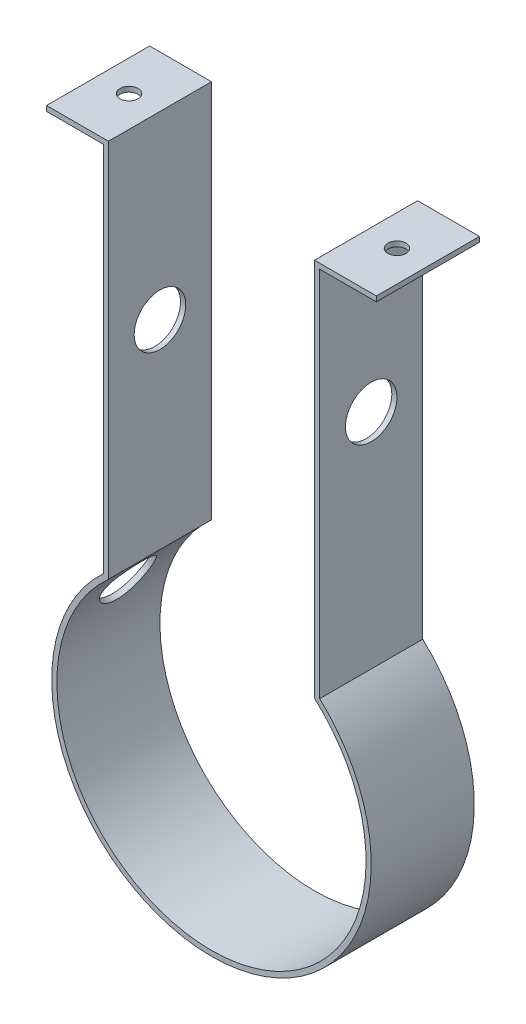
ISO-10303-21;
HEADER;
FILE_DESCRIPTION(('STEP AP214'),'2;1');
FILE_NAME('part.step','',(''),(''),'','','');
FILE_SCHEMA(('AUTOMOTIVE_DESIGN { 1 0 10303 214 1 1 1 1 }'));
ENDSEC;
DATA;
#1=APPLICATION_CONTEXT('core data for automotive mechanical design processes');
#2=APPLICATION_PROTOCOL_DEFINITION('international standard','automotive_design',2000,#1);
#3=PRODUCT_CONTEXT('',#1,'mechanical');
#4=PRODUCT('Part','Part','',(#3));
#5=PRODUCT_RELATED_PRODUCT_CATEGORY('part','',(#4));
#6=PRODUCT_DEFINITION_FORMATION('','',#4);
#7=PRODUCT_DEFINITION_CONTEXT('part definition',#1,'design');
#8=PRODUCT_DEFINITION('design','',#6,#7);
#9=PRODUCT_DEFINITION_SHAPE('','',#8);
#10=(LENGTH_UNIT() NAMED_UNIT(*) SI_UNIT(.MILLI.,.METRE.));
#11=(NAMED_UNIT(*) PLANE_ANGLE_UNIT() SI_UNIT($,.RADIAN.));
#12=(NAMED_UNIT(*) SI_UNIT($,.STERADIAN.) SOLID_ANGLE_UNIT());
#13=UNCERTAINTY_MEASURE_WITH_UNIT(LENGTH_MEASURE(1.E-05),#10,'distance_accuracy_value','');
#14=(GEOMETRIC_REPRESENTATION_CONTEXT(3) GLOBAL_UNCERTAINTY_ASSIGNED_CONTEXT((#13)) GLOBAL_UNIT_ASSIGNED_CONTEXT((#10,
#11,#12)) REPRESENTATION_CONTEXT('',''));
#15=CARTESIAN_POINT('',(0.,0.,0.));
#16=DIRECTION('',(0.,0.,1.));
#17=DIRECTION('',(1.,0.,0.));
#18=AXIS2_PLACEMENT_3D('',#15,#16,#17);
#19=CARTESIAN_POINT('',(0.,0.,20.));
#20=DIRECTION('',(0.,0.,-1.));
#21=DIRECTION('',(-1.,0.,0.));
#22=AXIS2_PLACEMENT_3D('',#19,#20,#21);
#23=CYLINDRICAL_SURFACE('',#22,30.);
#24=CARTESIAN_POINT('',(-28.3312870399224,9.866011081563,10.));
#25=CARTESIAN_POINT('',(-28.3312872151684,9.86600872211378,10.1394236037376));
#26=CARTESIAN_POINT('',(-28.3293427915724,9.87159902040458,10.2788181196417));
#27=CARTESIAN_POINT('',(-28.3215612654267,9.89390298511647,10.5566479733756));
#28=CARTESIAN_POINT('',(-28.3157233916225,9.91061885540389,10.695083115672));
#29=CARTESIAN_POINT('',(-28.3001389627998,9.95503315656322,10.9700426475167));
#30=CARTESIAN_POINT('',(-28.2903899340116,9.98273853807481,11.1065657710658));
#31=CARTESIAN_POINT('',(-28.2669632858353,10.0488813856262,11.3766966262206));
#32=CARTESIAN_POINT('',(-28.2532842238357,10.0873227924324,11.5103032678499));
#33=CARTESIAN_POINT('',(-28.2219986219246,10.1745238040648,11.7734487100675));
#34=CARTESIAN_POINT('',(-28.2043968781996,10.2232708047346,11.9029922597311));
#35=CARTESIAN_POINT('',(-28.1652288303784,10.3306898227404,12.1573324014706));
#36=CARTESIAN_POINT('',(-28.143661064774,10.3893654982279,12.2821272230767));
#37=CARTESIAN_POINT('',(-28.0965588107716,10.5160804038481,12.526005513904));
#38=CARTESIAN_POINT('',(-28.0710262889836,10.5841149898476,12.6450917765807));
#39=CARTESIAN_POINT('',(-28.0159649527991,10.7290127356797,12.8768565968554));
#40=CARTESIAN_POINT('',(-27.9864346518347,10.8058791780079,12.9895327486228));
#41=CARTESIAN_POINT('',(-27.9231177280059,10.9684624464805,13.2085948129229));
#42=CARTESIAN_POINT('',(-27.8892972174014,11.054248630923,13.3149194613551));
#43=CARTESIAN_POINT('',(-27.8176029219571,11.2334447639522,13.5195432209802));
#44=CARTESIAN_POINT('',(-27.7797276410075,11.3268575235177,13.6178393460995));
#45=CARTESIAN_POINT('',(-27.6999874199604,11.5204884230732,13.8056575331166));
#46=CARTESIAN_POINT('',(-27.6581237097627,11.6207044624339,13.8951822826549));
#47=CARTESIAN_POINT('',(-27.5704528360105,11.8272023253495,14.0649008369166));
#48=CARTESIAN_POINT('',(-27.5246442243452,11.9334863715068,14.1450911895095));
#49=CARTESIAN_POINT('',(-27.428937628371,12.1518585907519,14.2959588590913));
#50=CARTESIAN_POINT('',(-27.3790181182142,12.2639760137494,14.3665802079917));
#51=CARTESIAN_POINT('',(-27.2754543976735,12.492611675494,14.4972839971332));
#52=CARTESIAN_POINT('',(-27.2218088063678,12.6091315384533,14.55736250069));
#53=CARTESIAN_POINT('',(-27.1110340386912,12.8455770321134,14.6664777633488));
#54=CARTESIAN_POINT('',(-27.0539063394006,12.965501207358,14.7155191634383));
#55=CARTESIAN_POINT('',(-26.9364160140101,13.2078648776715,14.802233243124));
#56=CARTESIAN_POINT('',(-26.8760522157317,13.330305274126,14.8399017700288));
#57=CARTESIAN_POINT('',(-26.6917504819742,13.6976132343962,14.9347309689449));
#58=CARTESIAN_POINT('',(-26.5634487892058,13.944941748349,14.9748513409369));
#59=CARTESIAN_POINT('',(-26.2986293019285,14.4381641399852,15.0078459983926));
#60=CARTESIAN_POINT('',(-26.1621120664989,14.6840581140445,15.0007234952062));
#61=CARTESIAN_POINT('',(-25.8862100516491,15.1650988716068,14.9398334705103));
#62=CARTESIAN_POINT('',(-25.7468670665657,15.4003279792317,14.8865286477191));
#63=CARTESIAN_POINT('',(-25.4685895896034,15.8563033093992,14.7354988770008));
#64=CARTESIAN_POINT('',(-25.3296551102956,16.0770490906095,14.6377725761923));
#65=CARTESIAN_POINT('',(-25.0564917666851,16.4995714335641,14.4002184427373));
#66=CARTESIAN_POINT('',(-24.9222873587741,16.7012565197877,14.2601999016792));
#67=CARTESIAN_POINT('',(-24.6643615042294,17.0798662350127,13.9421744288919));
#68=CARTESIAN_POINT('',(-24.5406409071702,17.2567888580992,13.7641644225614));
#69=CARTESIAN_POINT('',(-24.3072703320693,17.5840144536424,13.372642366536));
#70=CARTESIAN_POINT('',(-24.1978092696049,17.7339684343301,13.1587258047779));
#71=CARTESIAN_POINT('',(-23.9995529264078,18.0013681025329,12.7028258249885));
#72=CARTESIAN_POINT('',(-23.9107578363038,18.1188134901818,12.4608421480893));
#73=CARTESIAN_POINT('',(-23.7578949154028,18.3187981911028,11.9552167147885));
#74=CARTESIAN_POINT('',(-23.6938548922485,18.4012982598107,11.6915510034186));
#75=CARTESIAN_POINT('',(-23.5938276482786,18.5293811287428,11.1503018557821));
#76=CARTESIAN_POINT('',(-23.5578379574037,18.5749671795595,10.8727196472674));
#77=CARTESIAN_POINT('',(-23.5160161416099,18.6278856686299,10.3150676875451));
#78=CARTESIAN_POINT('',(-23.5098289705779,18.6356684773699,10.035067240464));
#79=CARTESIAN_POINT('',(-23.5269662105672,18.6140281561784,9.4774266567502));
#80=CARTESIAN_POINT('',(-23.5502894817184,18.5846064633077,9.19978642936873));
#81=CARTESIAN_POINT('',(-23.6250139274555,18.489518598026,8.65654448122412));
#82=CARTESIAN_POINT('',(-23.6762365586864,18.4240828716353,8.39087771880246));
#83=CARTESIAN_POINT('',(-23.8041391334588,18.258527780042,7.87705966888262));
#84=CARTESIAN_POINT('',(-23.8808205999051,18.1584063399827,7.62890943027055));
#85=CARTESIAN_POINT('',(-24.0568972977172,17.9244871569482,7.15465080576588));
#86=CARTESIAN_POINT('',(-24.1564955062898,17.7903873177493,6.92876683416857));
#87=CARTESIAN_POINT('',(-24.3735800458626,17.4917861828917,6.50777295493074));
#88=CARTESIAN_POINT('',(-24.4910676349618,17.327282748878,6.31266521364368));
#89=CARTESIAN_POINT('',(-24.7403100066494,16.969531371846,5.95669613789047));
#90=CARTESIAN_POINT('',(-24.8722004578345,16.7760022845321,5.7962120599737));
#91=CARTESIAN_POINT('',(-25.1439197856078,16.3659306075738,5.51668963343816));
#92=CARTESIAN_POINT('',(-25.2837484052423,16.1493887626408,5.39764994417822));
#93=CARTESIAN_POINT('',(-25.5654008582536,15.6996931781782,5.20497776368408));
#94=CARTESIAN_POINT('',(-25.7072132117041,15.4666166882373,5.13114786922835));
#95=CARTESIAN_POINT('',(-25.9885541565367,14.9890500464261,5.03037278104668));
#96=CARTESIAN_POINT('',(-26.1280829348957,14.7445608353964,5.00342372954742));
#97=CARTESIAN_POINT('',(-26.3313576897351,14.3763407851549,4.99876099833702));
#98=CARTESIAN_POINT('',(-26.397756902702,14.2540431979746,5.00304474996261));
#99=CARTESIAN_POINT('',(-26.5284535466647,14.0092943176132,5.02318820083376));
#100=CARTESIAN_POINT('',(-26.5927517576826,13.8868430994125,5.03904355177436));
#101=CARTESIAN_POINT('',(-26.7188574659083,13.6426378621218,5.08222169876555));
#102=CARTESIAN_POINT('',(-26.780664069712,13.5208841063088,5.10954856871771));
#103=CARTESIAN_POINT('',(-26.9013924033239,13.2790564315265,5.17544736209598));
#104=CARTESIAN_POINT('',(-26.9603151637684,13.1589819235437,5.21401523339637));
#105=CARTESIAN_POINT('',(-27.0749544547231,12.9214635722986,5.30207797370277));
#106=CARTESIAN_POINT('',(-27.1306734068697,12.804017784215,5.35156444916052));
#107=CARTESIAN_POINT('',(-27.2386911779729,12.572589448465,5.46109866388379));
#108=CARTESIAN_POINT('',(-27.2909912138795,12.4586056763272,5.52114261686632));
#109=CARTESIAN_POINT('',(-27.3920206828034,12.2348794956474,5.65139888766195));
#110=CARTESIAN_POINT('',(-27.440748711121,12.1251387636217,5.72161517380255));
#111=CARTESIAN_POINT('',(-27.534450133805,11.9108241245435,5.87167844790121));
#112=CARTESIAN_POINT('',(-27.5794248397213,11.8062484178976,5.95152204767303));
#113=CARTESIAN_POINT('',(-27.6660456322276,11.6018269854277,6.12130955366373));
#114=CARTESIAN_POINT('',(-27.7076460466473,11.5020518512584,6.21136177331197));
#115=CARTESIAN_POINT('',(-27.7868328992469,11.309410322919,6.40012486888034));
#116=CARTESIAN_POINT('',(-27.824420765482,11.2165414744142,6.49883264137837));
#117=CARTESIAN_POINT('',(-27.8955817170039,11.0383753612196,6.70431932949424));
#118=CARTESIAN_POINT('',(-27.9291523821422,10.9530826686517,6.81110304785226));
#119=CARTESIAN_POINT('',(-27.9922250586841,10.7908715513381,7.0319184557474));
#120=CARTESIAN_POINT('',(-28.0217285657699,10.7139500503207,7.14594745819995));
#121=CARTESIAN_POINT('',(-28.0768882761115,10.5685589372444,7.38138656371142));
#122=CARTESIAN_POINT('',(-28.10251410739,10.5001567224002,7.50284542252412));
#123=CARTESIAN_POINT('',(-28.1496563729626,10.3731112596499,7.75146934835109));
#124=CARTESIAN_POINT('',(-28.1711743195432,10.314464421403,7.87863229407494));
#125=CARTESIAN_POINT('',(-28.210118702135,10.2074701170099,8.13772401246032));
#126=CARTESIAN_POINT('',(-28.2275479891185,10.1591154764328,8.2696493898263));
#127=CARTESIAN_POINT('',(-28.2583510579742,10.073116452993,8.53736024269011));
#128=CARTESIAN_POINT('',(-28.2717257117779,10.0354697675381,8.67314488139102));
#129=CARTESIAN_POINT('',(-28.2991694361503,9.95788037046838,9.00472207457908));
#130=CARTESIAN_POINT('',(-28.3112186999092,9.92348113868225,9.20200940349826));
#131=CARTESIAN_POINT('',(-28.3272773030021,9.87754839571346,9.59955118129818));
#132=CARTESIAN_POINT('',(-28.3312867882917,9.86601446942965,9.79980557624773));
#133=CARTESIAN_POINT('',(-28.3312870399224,9.866011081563,10.));
#134=B_SPLINE_CURVE_WITH_KNOTS('',3,(#24,#25,#26,#27,#28,#29,#30,#31,#32,#33,#34,#35,#36,#37,
#38,#39,#40,#41,#42,#43,#44,#45,#46,#47,#48,#49,#50,#51,#52,#53,#54,#55,#56,#57,#58,#59,#60,#61,
#62,#63,#64,#65,#66,#67,#68,#69,#70,#71,#72,#73,#74,#75,#76,#77,#78,#79,#80,#81,#82,#83,#84,#85,
#86,#87,#88,#89,#90,#91,#92,#93,#94,#95,#96,#97,#98,#99,#100,#101,#102,#103,#104,#105,#106,#107,
#108,#109,#110,#111,#112,#113,#114,#115,#116,#117,#118,#119,#120,#121,#122,#123,#124,#125,#126,
#127,#128,#129,#130,#131,#132,#133),.UNSPECIFIED.,.T.,.F.,(4,2,2,2,2,2,2,2,2,2,2,2,2,2,2,2,2,2,
2,2,2,2,2,2,2,2,2,2,2,2,2,2,2,2,2,2,2,2,2,2,2,2,2,2,2,2,2,2,2,2,2,2,2,2,4),(0.,
0.418095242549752,0.836273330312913,1.25471632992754,1.67331312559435,2.09140089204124,
2.50964303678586,2.92767838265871,3.34586960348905,3.76759791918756,4.18948238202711,
4.61123716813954,5.03314743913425,5.45742771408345,5.88186607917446,6.30612563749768,
6.73053992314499,7.57061257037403,8.41062811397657,9.24232364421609,10.0740445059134,
10.9095733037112,11.745169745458,12.5909036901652,13.4366454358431,14.2833344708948,
15.1299489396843,15.9664520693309,16.8029228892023,17.6341025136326,18.4653318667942,
19.3042280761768,20.1431833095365,20.9908634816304,21.8385162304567,22.6824409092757,
23.5262961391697,23.9435677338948,24.3606826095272,24.7779457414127,25.1950586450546,
25.6118520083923,26.0284961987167,26.4453033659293,26.8619642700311,27.2835543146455,
27.7049938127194,28.1266859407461,28.5482225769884,28.9729067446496,29.3974342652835,
29.8216648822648,30.2458042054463,30.8461462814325,31.4464774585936),.UNSPECIFIED.);
#135=CARTESIAN_POINT('',(-28.3312870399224,9.866011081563,10.));
#136=VERTEX_POINT('',#135);
#137=EDGE_CURVE('E281',#136,#136,#134,.T.);
#138=ORIENTED_EDGE('',*,*,#137,.T.);
#139=EDGE_LOOP('',(#138));
#140=FACE_BOUND('',#139,.T.);
#141=CARTESIAN_POINT('',(0.,0.,0.));
#142=DIRECTION('',(0.,0.,-1.));
#143=DIRECTION('',(1.,0.,0.));
#144=AXIS2_PLACEMENT_3D('',#141,#142,#143);
#145=CIRCLE('',#144,30.);
#146=CARTESIAN_POINT('',(20.,22.3606797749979,0.));
#147=VERTEX_POINT('',#146);
#148=CARTESIAN_POINT('',(-20.,22.3606797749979,0.));
#149=VERTEX_POINT('',#148);
#150=EDGE_CURVE('E158',#147,#149,#145,.T.);
#151=ORIENTED_EDGE('',*,*,#150,.T.);
#152=DIRECTION('',(0.,0.,-1.));
#153=VECTOR('',#152,1.);
#154=CARTESIAN_POINT('',(-20.,22.3606797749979,20.));
#155=LINE('',#154,#153);
#156=CARTESIAN_POINT('',(-20.,22.3606797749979,20.));
#157=VERTEX_POINT('',#156);
#158=EDGE_CURVE('E11',#157,#149,#155,.T.);
#159=ORIENTED_EDGE('',*,*,#158,.F.);
#160=CARTESIAN_POINT('',(0.,0.,20.));
#161=DIRECTION('',(0.,0.,-1.));
#162=DIRECTION('',(1.,0.,0.));
#163=AXIS2_PLACEMENT_3D('',#160,#161,#162);
#164=CIRCLE('',#163,30.);
#165=CARTESIAN_POINT('',(20.,22.3606797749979,20.));
#166=VERTEX_POINT('',#165);
#167=EDGE_CURVE('E181',#166,#157,#164,.T.);
#168=ORIENTED_EDGE('',*,*,#167,.F.);
#169=DIRECTION('',(0.,0.,-1.));
#170=VECTOR('',#169,1.);
#171=CARTESIAN_POINT('',(20.,22.3606797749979,20.));
#172=LINE('',#171,#170);
#173=EDGE_CURVE('E154',#166,#147,#172,.T.);
#174=ORIENTED_EDGE('',*,*,#173,.T.);
#175=EDGE_LOOP('',(#151,#159,#168,#174));
#176=FACE_BOUND('',#175,.T.);
#177=ADVANCED_FACE('F31',(#140,#176),#23,.F.);
#178=CARTESIAN_POINT('',(-20.,22.3606797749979,20.));
#179=DIRECTION('',(-1.,0.,0.));
#180=DIRECTION('',(0.,0.,1.));
#181=AXIS2_PLACEMENT_3D('',#178,#179,#180);
#182=PLANE('',#181);
#183=CARTESIAN_POINT('',(-20.,61.,10.));
#184=DIRECTION('',(-1.,0.,0.));
#185=DIRECTION('',(0.,0.,1.));
#186=AXIS2_PLACEMENT_3D('',#183,#184,#185);
#187=CIRCLE('',#186,5.);
#188=CARTESIAN_POINT('',(-20.,61.,15.));
#189=VERTEX_POINT('',#188);
#190=EDGE_CURVE('E217',#189,#189,#187,.T.);
#191=ORIENTED_EDGE('',*,*,#190,.T.);
#192=EDGE_LOOP('',(#191));
#193=FACE_BOUND('',#192,.T.);
#194=DIRECTION('',(0.,1.,0.));
#195=VECTOR('',#194,1.);
#196=CARTESIAN_POINT('',(-20.,22.3606797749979,0.));
#197=LINE('',#196,#195);
#198=CARTESIAN_POINT('',(-20.,96.,0.));
#199=VERTEX_POINT('',#198);
#200=EDGE_CURVE('E161',#149,#199,#197,.T.);
#201=ORIENTED_EDGE('',*,*,#200,.T.);
#202=DIRECTION('',(0.,0.,-1.));
#203=VECTOR('',#202,1.);
#204=CARTESIAN_POINT('',(-20.,96.,20.));
#205=LINE('',#204,#203);
#206=CARTESIAN_POINT('',(-20.,96.,20.));
#207=VERTEX_POINT('',#206);
#208=EDGE_CURVE('E45',#207,#199,#205,.T.);
#209=ORIENTED_EDGE('',*,*,#208,.F.);
#210=DIRECTION('',(0.,1.,0.));
#211=VECTOR('',#210,1.);
#212=CARTESIAN_POINT('',(-20.,22.3606797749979,20.));
#213=LINE('',#212,#211);
#214=EDGE_CURVE('E109',#157,#207,#213,.T.);
#215=ORIENTED_EDGE('',*,*,#214,.F.);
#216=ORIENTED_EDGE('',*,*,#158,.T.);
#217=EDGE_LOOP('',(#201,#209,#215,#216));
#218=FACE_BOUND('',#217,.T.);
#219=ADVANCED_FACE('F272',(#193,#218),#182,.F.);
#220=CARTESIAN_POINT('',(-20.,96.,20.));
#221=DIRECTION('',(0.,-1.,0.));
#222=DIRECTION('',(0.,0.,-1.));
#223=AXIS2_PLACEMENT_3D('',#220,#221,#222);
#224=PLANE('',#223);
#225=CARTESIAN_POINT('',(-26.,96.,10.));
#226=DIRECTION('',(0.,1.,0.));
#227=DIRECTION('',(0.,0.,1.));
#228=AXIS2_PLACEMENT_3D('',#225,#226,#227);
#229=CIRCLE('',#228,1.75);
#230=CARTESIAN_POINT('',(-26.,96.,11.75));
#231=VERTEX_POINT('',#230);
#232=EDGE_CURVE('E208',#231,#231,#229,.T.);
#233=ORIENTED_EDGE('',*,*,#232,.F.);
#234=EDGE_LOOP('',(#233));
#235=FACE_BOUND('',#234,.T.);
#236=DIRECTION('',(-1.,0.,0.));
#237=VECTOR('',#236,1.);
#238=CARTESIAN_POINT('',(-20.,96.,0.));
#239=LINE('',#238,#237);
#240=CARTESIAN_POINT('',(-32.,96.,0.));
#241=VERTEX_POINT('',#240);
#242=EDGE_CURVE('E164',#199,#241,#239,.T.);
#243=ORIENTED_EDGE('',*,*,#242,.T.);
#244=DIRECTION('',(0.,0.,-1.));
#245=VECTOR('',#244,1.);
#246=CARTESIAN_POINT('',(-32.,96.,20.));
#247=LINE('',#246,#245);
#248=CARTESIAN_POINT('',(-32.,96.,20.));
#249=VERTEX_POINT('',#248);
#250=EDGE_CURVE('E200',#249,#241,#247,.T.);
#251=ORIENTED_EDGE('',*,*,#250,.F.);
#252=DIRECTION('',(-1.,0.,0.));
#253=VECTOR('',#252,1.);
#254=CARTESIAN_POINT('',(-20.,96.,20.));
#255=LINE('',#254,#253);
#256=EDGE_CURVE('E232',#207,#249,#255,.T.);
#257=ORIENTED_EDGE('',*,*,#256,.F.);
#258=ORIENTED_EDGE('',*,*,#208,.T.);
#259=EDGE_LOOP('',(#243,#251,#257,#258));
#260=FACE_BOUND('',#259,.T.);
#261=ADVANCED_FACE('F277',(#235,#260),#224,.F.);
#262=CARTESIAN_POINT('',(-32.,96.,20.));
#263=DIRECTION('',(1.,0.,0.));
#264=DIRECTION('',(0.,0.,-1.));
#265=AXIS2_PLACEMENT_3D('',#262,#263,#264);
#266=PLANE('',#265);
#267=DIRECTION('',(0.,-1.,0.));
#268=VECTOR('',#267,1.);
#269=CARTESIAN_POINT('',(-32.,96.,0.));
#270=LINE('',#269,#268);
#271=CARTESIAN_POINT('',(-32.,95.,0.));
#272=VERTEX_POINT('',#271);
#273=EDGE_CURVE('E166',#241,#272,#270,.T.);
#274=ORIENTED_EDGE('',*,*,#273,.T.);
#275=DIRECTION('',(0.,0.,-1.));
#276=VECTOR('',#275,1.);
#277=CARTESIAN_POINT('',(-32.,95.,20.));
#278=LINE('',#277,#276);
#279=CARTESIAN_POINT('',(-32.,95.,20.));
#280=VERTEX_POINT('',#279);
#281=EDGE_CURVE('E197',#280,#272,#278,.T.);
#282=ORIENTED_EDGE('',*,*,#281,.F.);
#283=DIRECTION('',(0.,-1.,0.));
#284=VECTOR('',#283,1.);
#285=CARTESIAN_POINT('',(-32.,96.,20.));
#286=LINE('',#285,#284);
#287=EDGE_CURVE('E234',#249,#280,#286,.T.);
#288=ORIENTED_EDGE('',*,*,#287,.F.);
#289=ORIENTED_EDGE('',*,*,#250,.T.);
#290=EDGE_LOOP('',(#274,#282,#288,#289));
#291=FACE_BOUND('',#290,.T.);
#292=ADVANCED_FACE('F369',(#291),#266,.F.);
#293=CARTESIAN_POINT('',(-21.,95.,20.));
#294=DIRECTION('',(0.,1.,0.));
#295=DIRECTION('',(0.,0.,1.));
#296=AXIS2_PLACEMENT_3D('',#293,#294,#295);
#297=PLANE('',#296);
#298=CARTESIAN_POINT('',(-26.,95.,10.));
#299=DIRECTION('',(0.,1.,0.));
#300=DIRECTION('',(0.,0.,1.));
#301=AXIS2_PLACEMENT_3D('',#298,#299,#300);
#302=CIRCLE('',#301,1.75);
#303=CARTESIAN_POINT('',(-26.,95.,11.75));
#304=VERTEX_POINT('',#303);
#305=EDGE_CURVE('E205',#304,#304,#302,.T.);
#306=ORIENTED_EDGE('',*,*,#305,.T.);
#307=EDGE_LOOP('',(#306));
#308=FACE_BOUND('',#307,.T.);
#309=DIRECTION('',(1.,0.,0.));
#310=VECTOR('',#309,1.);
#311=CARTESIAN_POINT('',(-21.,95.,0.));
#312=LINE('',#311,#310);
#313=CARTESIAN_POINT('',(-21.,95.,0.));
#314=VERTEX_POINT('',#313);
#315=EDGE_CURVE('E168',#272,#314,#312,.T.);
#316=ORIENTED_EDGE('',*,*,#315,.T.);
#317=DIRECTION('',(0.,0.,-1.));
#318=VECTOR('',#317,1.);
#319=CARTESIAN_POINT('',(-21.,95.,20.));
#320=LINE('',#319,#318);
#321=CARTESIAN_POINT('',(-21.,95.,20.));
#322=VERTEX_POINT('',#321);
#323=EDGE_CURVE('E194',#322,#314,#320,.T.);
#324=ORIENTED_EDGE('',*,*,#323,.F.);
#325=DIRECTION('',(1.,0.,0.));
#326=VECTOR('',#325,1.);
#327=CARTESIAN_POINT('',(-21.,95.,20.));
#328=LINE('',#327,#326);
#329=EDGE_CURVE('E236',#280,#322,#328,.T.);
#330=ORIENTED_EDGE('',*,*,#329,.F.);
#331=ORIENTED_EDGE('',*,*,#281,.T.);
#332=EDGE_LOOP('',(#316,#324,#330,#331));
#333=FACE_BOUND('',#332,.T.);
#334=ADVANCED_FACE('F379',(#308,#333),#297,.F.);
#335=CARTESIAN_POINT('',(-21.,22.8035085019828,20.));
#336=DIRECTION('',(1.,0.,0.));
#337=DIRECTION('',(0.,0.,-1.));
#338=AXIS2_PLACEMENT_3D('',#335,#336,#337);
#339=PLANE('',#338);
#340=CARTESIAN_POINT('',(-21.,61.,10.));
#341=DIRECTION('',(-1.,0.,0.));
#342=DIRECTION('',(0.,0.,1.));
#343=AXIS2_PLACEMENT_3D('',#340,#341,#342);
#344=CIRCLE('',#343,5.);
#345=CARTESIAN_POINT('',(-21.,61.,15.));
#346=VERTEX_POINT('',#345);
#347=EDGE_CURVE('E222',#346,#346,#344,.T.);
#348=ORIENTED_EDGE('',*,*,#347,.F.);
#349=EDGE_LOOP('',(#348));
#350=FACE_BOUND('',#349,.T.);
#351=DIRECTION('',(0.,-1.,0.));
#352=VECTOR('',#351,1.);
#353=CARTESIAN_POINT('',(-21.,22.8035085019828,0.));
#354=LINE('',#353,#352);
#355=CARTESIAN_POINT('',(-21.,22.8035085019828,0.));
#356=VERTEX_POINT('',#355);
#357=EDGE_CURVE('E170',#314,#356,#354,.T.);
#358=ORIENTED_EDGE('',*,*,#357,.T.);
#359=DIRECTION('',(0.,0.,-1.));
#360=VECTOR('',#359,1.);
#361=CARTESIAN_POINT('',(-21.,22.8035085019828,20.));
#362=LINE('',#361,#360);
#363=CARTESIAN_POINT('',(-21.,22.8035085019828,20.));
#364=VERTEX_POINT('',#363);
#365=EDGE_CURVE('E191',#364,#356,#362,.T.);
#366=ORIENTED_EDGE('',*,*,#365,.F.);
#367=DIRECTION('',(0.,-1.,0.));
#368=VECTOR('',#367,1.);
#369=CARTESIAN_POINT('',(-21.,22.8035085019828,20.));
#370=LINE('',#369,#368);
#371=EDGE_CURVE('E238',#322,#364,#370,.T.);
#372=ORIENTED_EDGE('',*,*,#371,.F.);
#373=ORIENTED_EDGE('',*,*,#323,.T.);
#374=EDGE_LOOP('',(#358,#366,#372,#373));
#375=FACE_BOUND('',#374,.T.);
#376=ADVANCED_FACE('F347',(#350,#375),#339,.F.);
#377=CARTESIAN_POINT('',(0.,0.,20.));
#378=DIRECTION('',(0.,0.,-1.));
#379=DIRECTION('',(-1.,0.,0.));
#380=AXIS2_PLACEMENT_3D('',#377,#378,#379);
#381=CYLINDRICAL_SURFACE('',#380,31.);
#382=CARTESIAN_POINT('',(-29.2196653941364,10.3542819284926,10.));
#383=CARTESIAN_POINT('',(-29.2196655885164,10.3542796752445,9.8605093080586));
#384=CARTESIAN_POINT('',(-29.2176905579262,10.3598595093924,9.72104689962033));
#385=CARTESIAN_POINT('',(-29.2097873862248,10.3821225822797,9.44308076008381));
#386=CARTESIAN_POINT('',(-29.2038584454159,10.39880806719,9.30457722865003));
#387=CARTESIAN_POINT('',(-29.1880334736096,10.4431438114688,9.02947817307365));
#388=CARTESIAN_POINT('',(-29.1781348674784,10.4708011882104,8.89288394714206));
#389=CARTESIAN_POINT('',(-29.1543543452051,10.53683319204,8.62261121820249));
#390=CARTESIAN_POINT('',(-29.1404709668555,10.5752117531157,8.48893380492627));
#391=CARTESIAN_POINT('',(-29.1087270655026,10.6622770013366,8.22564537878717));
#392=CARTESIAN_POINT('',(-29.090871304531,10.7109513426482,8.09602970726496));
#393=CARTESIAN_POINT('',(-29.0511518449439,10.818218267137,7.84154914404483));
#394=CARTESIAN_POINT('',(-29.0292866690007,10.8768145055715,7.71668602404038));
#395=CARTESIAN_POINT('',(-28.9815541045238,11.0033672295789,7.47267858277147));
#396=CARTESIAN_POINT('',(-28.9556887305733,11.0713190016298,7.35353142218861));
#397=CARTESIAN_POINT('',(-28.8999342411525,11.2160516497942,7.12165417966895));
#398=CARTESIAN_POINT('',(-28.8700436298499,11.2928358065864,7.00892650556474));
#399=CARTESIAN_POINT('',(-28.8060025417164,11.4552124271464,6.78983420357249));
#400=CARTESIAN_POINT('',(-28.7718202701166,11.5408696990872,6.68352689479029));
#401=CARTESIAN_POINT('',(-28.6993982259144,11.7198062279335,6.478944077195));
#402=CARTESIAN_POINT('',(-28.6611569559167,11.8130882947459,6.38067155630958));
#403=CARTESIAN_POINT('',(-28.5806909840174,12.0064592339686,6.19290831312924));
#404=CARTESIAN_POINT('',(-28.5384675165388,12.1065459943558,6.1034148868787));
#405=CARTESIAN_POINT('',(-28.4500931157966,12.312789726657,5.93376723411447));
#406=CARTESIAN_POINT('',(-28.4039407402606,12.4189489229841,5.85361646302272));
#407=CARTESIAN_POINT('',(-28.3075894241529,12.6370353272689,5.70286590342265));
#408=CARTESIAN_POINT('',(-28.2573705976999,12.7489897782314,5.63231821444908));
#409=CARTESIAN_POINT('',(-28.1532461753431,12.9773064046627,5.5017609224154));
#410=CARTESIAN_POINT('',(-28.0993392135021,13.0936702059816,5.44175525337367));
#411=CARTESIAN_POINT('',(-27.9880874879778,13.3298149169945,5.33278275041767));
#412=CARTESIAN_POINT('',(-27.9307441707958,13.4495943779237,5.28381131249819));
#413=CARTESIAN_POINT('',(-27.8128745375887,13.6916836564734,5.19723241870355));
#414=CARTESIAN_POINT('',(-27.7523470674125,13.8139943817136,5.15962911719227));
#415=CARTESIAN_POINT('',(-27.567571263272,14.1810860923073,5.0649475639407));
#416=CARTESIAN_POINT('',(-27.4390356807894,14.4283596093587,5.02492632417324));
#417=CARTESIAN_POINT('',(-27.1739795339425,14.9215734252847,4.99214603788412));
#418=CARTESIAN_POINT('',(-27.0374594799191,15.1675138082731,4.99938397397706));
#419=CARTESIAN_POINT('',(-26.7616874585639,15.6489070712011,5.06053757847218));
#420=CARTESIAN_POINT('',(-26.6224725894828,15.8844360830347,5.11401955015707));
#421=CARTESIAN_POINT('',(-26.3446469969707,16.3410855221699,5.26547766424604));
#422=CARTESIAN_POINT('',(-26.2060362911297,16.5622055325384,5.36345509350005));
#423=CARTESIAN_POINT('',(-25.9337208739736,16.9854579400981,5.60155388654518));
#424=CARTESIAN_POINT('',(-25.800039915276,17.1875042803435,5.74185529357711));
#425=CARTESIAN_POINT('',(-25.5432760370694,17.5668322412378,6.06048884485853));
#426=CARTESIAN_POINT('',(-25.4201939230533,17.744111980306,6.23882387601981));
#427=CARTESIAN_POINT('',(-25.1882567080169,18.0718723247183,6.63087178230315));
#428=CARTESIAN_POINT('',(-25.0795791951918,18.2220254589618,6.84496369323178));
#429=CARTESIAN_POINT('',(-24.8828512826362,18.4897647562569,7.30116750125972));
#430=CARTESIAN_POINT('',(-24.7948010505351,18.6073506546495,7.54327962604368));
#431=CARTESIAN_POINT('',(-24.6433211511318,18.8075136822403,8.04906857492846));
#432=CARTESIAN_POINT('',(-24.5799161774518,18.890055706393,8.31276670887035));
#433=CARTESIAN_POINT('',(-24.4809637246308,19.0181236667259,8.85401195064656));
#434=CARTESIAN_POINT('',(-24.4454139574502,19.0636526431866,9.13155791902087));
#435=CARTESIAN_POINT('',(-24.4042084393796,19.1163734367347,9.68929348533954));
#436=CARTESIAN_POINT('',(-24.3982225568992,19.1239886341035,9.96941872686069));
#437=CARTESIAN_POINT('',(-24.4155535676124,19.1018568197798,10.5272675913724));
#438=CARTESIAN_POINT('',(-24.4388694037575,19.0721111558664,10.8049913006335));
#439=CARTESIAN_POINT('',(-24.5134046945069,18.9762115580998,11.3484837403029));
#440=CARTESIAN_POINT('',(-24.5644592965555,18.9102726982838,11.614313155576));
#441=CARTESIAN_POINT('',(-24.6918991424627,18.7435604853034,12.1283930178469));
#442=CARTESIAN_POINT('',(-24.7682858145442,18.642785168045,12.3766424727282));
#443=CARTESIAN_POINT('',(-24.9436428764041,18.4075069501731,12.8508802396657));
#444=CARTESIAN_POINT('',(-25.0428031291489,18.2727195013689,13.0766571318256));
#445=CARTESIAN_POINT('',(-25.2589674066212,17.9727199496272,13.4973590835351));
#446=CARTESIAN_POINT('',(-25.3759726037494,17.8075058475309,13.6922821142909));
#447=CARTESIAN_POINT('',(-25.6241723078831,17.4484896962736,14.0476683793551));
#448=CARTESIAN_POINT('',(-25.7554934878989,17.2544257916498,14.2077788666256));
#449=CARTESIAN_POINT('',(-26.0261355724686,16.8434171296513,14.4865274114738));
#450=CARTESIAN_POINT('',(-26.1654562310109,16.6264730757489,14.6051667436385));
#451=CARTESIAN_POINT('',(-26.4462474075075,16.1760975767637,14.7970561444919));
#452=CARTESIAN_POINT('',(-26.587706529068,15.9427387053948,14.8704935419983));
#453=CARTESIAN_POINT('',(-26.8685083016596,15.4647937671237,14.9704811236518));
#454=CARTESIAN_POINT('',(-27.0078511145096,15.2202085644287,14.9970349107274));
#455=CARTESIAN_POINT('',(-27.2110460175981,14.8518878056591,15.0011194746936));
#456=CARTESIAN_POINT('',(-27.2774762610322,14.7295154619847,14.9966379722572));
#457=CARTESIAN_POINT('',(-27.4082798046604,14.4846606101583,14.9760857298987));
#458=CARTESIAN_POINT('',(-27.4726538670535,14.3621781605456,14.9600193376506));
#459=CARTESIAN_POINT('',(-27.5989550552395,14.1179533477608,14.9164067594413));
#460=CARTESIAN_POINT('',(-27.6608813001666,13.9962112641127,14.8888564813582));
#461=CARTESIAN_POINT('',(-27.7818896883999,13.7544490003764,14.8224994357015));
#462=CARTESIAN_POINT('',(-27.8409728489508,13.6344282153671,14.783696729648));
#463=CARTESIAN_POINT('',(-27.955977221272,13.3970416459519,14.6951476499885));
#464=CARTESIAN_POINT('',(-28.0119003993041,13.27967423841,14.6454081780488));
#465=CARTESIAN_POINT('',(-28.1203563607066,13.0484428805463,14.5353553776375));
#466=CARTESIAN_POINT('',(-28.1728903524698,12.9345776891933,14.4750458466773));
#467=CARTESIAN_POINT('',(-28.2744105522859,12.7111280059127,14.3442473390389));
#468=CARTESIAN_POINT('',(-28.3233953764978,12.6015451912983,14.273754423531));
#469=CARTESIAN_POINT('',(-28.4176252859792,12.3875839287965,14.1231290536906));
#470=CARTESIAN_POINT('',(-28.4628716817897,12.2832036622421,14.0430000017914));
#471=CARTESIAN_POINT('',(-28.550015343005,12.0792821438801,13.8726911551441));
#472=CARTESIAN_POINT('',(-28.5918697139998,11.9798077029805,13.7824093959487));
#473=CARTESIAN_POINT('',(-28.6715672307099,11.7877918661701,13.5931964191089));
#474=CARTESIAN_POINT('',(-28.7094118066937,11.6952480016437,13.4942683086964));
#475=CARTESIAN_POINT('',(-28.7810798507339,11.5177519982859,13.2883528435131));
#476=CARTESIAN_POINT('',(-28.8149008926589,11.4328044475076,13.1813606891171));
#477=CARTESIAN_POINT('',(-28.8784584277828,11.271298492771,12.960143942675));
#478=CARTESIAN_POINT('',(-28.9081964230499,11.1947370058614,12.8459220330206));
#479=CARTESIAN_POINT('',(-28.9637882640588,11.0501138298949,12.6101731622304));
#480=CARTESIAN_POINT('',(-28.9896135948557,10.9821150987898,12.4886008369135));
#481=CARTESIAN_POINT('',(-29.0371253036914,10.855869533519,12.2397777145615));
#482=CARTESIAN_POINT('',(-29.0588132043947,10.797619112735,12.1125290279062));
#483=CARTESIAN_POINT('',(-29.0980600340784,10.6914035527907,11.8532967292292));
#484=CARTESIAN_POINT('',(-29.1156218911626,10.6434311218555,11.7213165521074));
#485=CARTESIAN_POINT('',(-29.1466466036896,10.5581742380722,11.4535256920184));
#486=CARTESIAN_POINT('',(-29.1601103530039,10.5208874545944,11.3177158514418));
#487=CARTESIAN_POINT('',(-29.1875904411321,10.4444655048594,10.9875550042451));
#488=CARTESIAN_POINT('',(-29.1996227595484,10.4106961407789,10.791768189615));
#489=CARTESIAN_POINT('',(-29.2156600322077,10.3656061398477,10.3973017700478));
#490=CARTESIAN_POINT('',(-29.2196651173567,10.3542851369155,10.1986222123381));
#491=CARTESIAN_POINT('',(-29.2196653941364,10.3542819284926,10.));
#492=B_SPLINE_CURVE_WITH_KNOTS('',3,(#382,#383,#384,#385,#386,#387,#388,#389,#390,#391,#392,
#393,#394,#395,#396,#397,#398,#399,#400,#401,#402,#403,#404,#405,#406,#407,#408,#409,#410,#411,
#412,#413,#414,#415,#416,#417,#418,#419,#420,#421,#422,#423,#424,#425,#426,#427,#428,#429,#430,
#431,#432,#433,#434,#435,#436,#437,#438,#439,#440,#441,#442,#443,#444,#445,#446,#447,#448,#449,
#450,#451,#452,#453,#454,#455,#456,#457,#458,#459,#460,#461,#462,#463,#464,#465,#466,#467,#468,
#469,#470,#471,#472,#473,#474,#475,#476,#477,#478,#479,#480,#481,#482,#483,#484,#485,#486,#487,
#488,#489,#490,#491),.UNSPECIFIED.,.T.,.F.,(4,2,2,2,2,2,2,2,2,2,2,2,2,2,2,2,2,2,2,2,2,2,2,2,2,2,
2,2,2,2,2,2,2,2,2,2,2,2,2,2,2,2,2,2,2,2,2,2,2,2,2,2,2,2,4),(0.,0.418297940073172,
0.836680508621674,1.25533492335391,1.67414315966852,2.09245201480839,2.51091531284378,
2.92916854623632,3.34757763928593,3.76929297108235,4.19116442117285,4.61290552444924,
5.03480211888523,5.45890342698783,5.88316266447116,6.30724455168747,6.73148122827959,
7.57169079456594,8.41184671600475,9.24420771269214,10.076592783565,10.912569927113,
11.7486105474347,12.5941527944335,13.4397019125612,14.2860960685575,15.1324206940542,
15.9692729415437,16.8060950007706,17.6379973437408,18.4699465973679,19.3091011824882,
20.1483109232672,20.9956642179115,21.8429914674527,22.6867830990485,23.5305098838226,
23.9480413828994,24.3654162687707,24.7829400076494,25.2003132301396,25.617423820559,
26.034384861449,26.4515076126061,26.8684835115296,27.2901016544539,27.7115688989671,
28.1332890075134,28.5548535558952,28.9793561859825,29.4037022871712,29.8277463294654,
30.2516978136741,30.8473262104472,31.4429448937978),.UNSPECIFIED.);
#493=CARTESIAN_POINT('',(-29.2196653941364,10.3542819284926,10.));
#494=VERTEX_POINT('',#493);
#495=EDGE_CURVE('E35',#494,#494,#492,.T.);
#496=ORIENTED_EDGE('',*,*,#495,.T.);
#497=EDGE_LOOP('',(#496));
#498=FACE_BOUND('',#497,.T.);
#499=CARTESIAN_POINT('',(0.,0.,0.));
#500=DIRECTION('',(0.,0.,1.));
#501=DIRECTION('',(1.,0.,0.));
#502=AXIS2_PLACEMENT_3D('',#499,#500,#501);
#503=CIRCLE('',#502,31.);
#504=CARTESIAN_POINT('',(21.,22.8035085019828,0.));
#505=VERTEX_POINT('',#504);
#506=EDGE_CURVE('E172',#356,#505,#503,.T.);
#507=ORIENTED_EDGE('',*,*,#506,.T.);
#508=DIRECTION('',(0.,0.,-1.));
#509=VECTOR('',#508,1.);
#510=CARTESIAN_POINT('',(21.,22.8035085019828,20.));
#511=LINE('',#510,#509);
#512=CARTESIAN_POINT('',(21.,22.8035085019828,20.));
#513=VERTEX_POINT('',#512);
#514=EDGE_CURVE('E188',#513,#505,#511,.T.);
#515=ORIENTED_EDGE('',*,*,#514,.F.);
#516=CARTESIAN_POINT('',(0.,0.,20.));
#517=DIRECTION('',(0.,0.,1.));
#518=DIRECTION('',(1.,0.,0.));
#519=AXIS2_PLACEMENT_3D('',#516,#517,#518);
#520=CIRCLE('',#519,31.);
#521=EDGE_CURVE('E240',#364,#513,#520,.T.);
#522=ORIENTED_EDGE('',*,*,#521,.F.);
#523=ORIENTED_EDGE('',*,*,#365,.T.);
#524=EDGE_LOOP('',(#507,#515,#522,#523));
#525=FACE_BOUND('',#524,.T.);
#526=ADVANCED_FACE('F343',(#498,#525),#381,.T.);
#527=CARTESIAN_POINT('',(21.,22.8035085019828,20.));
#528=DIRECTION('',(-1.,0.,0.));
#529=DIRECTION('',(0.,0.,1.));
#530=AXIS2_PLACEMENT_3D('',#527,#528,#529);
#531=PLANE('',#530);
#532=CARTESIAN_POINT('',(21.,66.,10.));
#533=DIRECTION('',(1.,0.,0.));
#534=DIRECTION('',(0.,0.,-1.));
#535=AXIS2_PLACEMENT_3D('',#532,#533,#534);
#536=CIRCLE('',#535,5.);
#537=CARTESIAN_POINT('',(21.,66.,5.));
#538=VERTEX_POINT('',#537);
#539=EDGE_CURVE('E211',#538,#538,#536,.T.);
#540=ORIENTED_EDGE('',*,*,#539,.F.);
#541=EDGE_LOOP('',(#540));
#542=FACE_BOUND('',#541,.T.);
#543=DIRECTION('',(0.,1.,0.));
#544=VECTOR('',#543,1.);
#545=CARTESIAN_POINT('',(21.,22.8035085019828,0.));
#546=LINE('',#545,#544);
#547=CARTESIAN_POINT('',(21.,95.,0.));
#548=VERTEX_POINT('',#547);
#549=EDGE_CURVE('E174',#505,#548,#546,.T.);
#550=ORIENTED_EDGE('',*,*,#549,.T.);
#551=DIRECTION('',(0.,0.,-1.));
#552=VECTOR('',#551,1.);
#553=CARTESIAN_POINT('',(21.,95.,20.));
#554=LINE('',#553,#552);
#555=CARTESIAN_POINT('',(21.,95.,20.));
#556=VERTEX_POINT('',#555);
#557=EDGE_CURVE('E185',#556,#548,#554,.T.);
#558=ORIENTED_EDGE('',*,*,#557,.F.);
#559=DIRECTION('',(0.,1.,0.));
#560=VECTOR('',#559,1.);
#561=CARTESIAN_POINT('',(21.,22.8035085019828,20.));
#562=LINE('',#561,#560);
#563=EDGE_CURVE('E242',#513,#556,#562,.T.);
#564=ORIENTED_EDGE('',*,*,#563,.F.);
#565=ORIENTED_EDGE('',*,*,#514,.T.);
#566=EDGE_LOOP('',(#550,#558,#564,#565));
#567=FACE_BOUND('',#566,.T.);
#568=ADVANCED_FACE('F248',(#542,#567),#531,.F.);
#569=CARTESIAN_POINT('',(21.,95.,20.));
#570=DIRECTION('',(0.,1.,0.));
#571=DIRECTION('',(0.,0.,1.));
#572=AXIS2_PLACEMENT_3D('',#569,#570,#571);
#573=PLANE('',#572);
#574=CARTESIAN_POINT('',(26.,95.,10.));
#575=DIRECTION('',(0.,1.,0.));
#576=DIRECTION('',(0.,0.,1.));
#577=AXIS2_PLACEMENT_3D('',#574,#575,#576);
#578=CIRCLE('',#577,1.75);
#579=CARTESIAN_POINT('',(26.,95.,11.75));
#580=VERTEX_POINT('',#579);
#581=EDGE_CURVE('E162',#580,#580,#578,.T.);
#582=ORIENTED_EDGE('',*,*,#581,.T.);
#583=EDGE_LOOP('',(#582));
#584=FACE_BOUND('',#583,.T.);
#585=DIRECTION('',(1.,0.,0.));
#586=VECTOR('',#585,1.);
#587=CARTESIAN_POINT('',(21.,95.,0.));
#588=LINE('',#587,#586);
#589=CARTESIAN_POINT('',(32.,95.,0.));
#590=VERTEX_POINT('',#589);
#591=EDGE_CURVE('E176',#548,#590,#588,.T.);
#592=ORIENTED_EDGE('',*,*,#591,.T.);
#593=DIRECTION('',(0.,0.,-1.));
#594=VECTOR('',#593,1.);
#595=CARTESIAN_POINT('',(32.,95.,20.));
#596=LINE('',#595,#594);
#597=CARTESIAN_POINT('',(32.,95.,20.));
#598=VERTEX_POINT('',#597);
#599=EDGE_CURVE('E149',#598,#590,#596,.T.);
#600=ORIENTED_EDGE('',*,*,#599,.F.);
#601=DIRECTION('',(1.,0.,0.));
#602=VECTOR('',#601,1.);
#603=CARTESIAN_POINT('',(21.,95.,20.));
#604=LINE('',#603,#602);
#605=EDGE_CURVE('E140',#556,#598,#604,.T.);
#606=ORIENTED_EDGE('',*,*,#605,.F.);
#607=ORIENTED_EDGE('',*,*,#557,.T.);
#608=EDGE_LOOP('',(#592,#600,#606,#607));
#609=FACE_BOUND('',#608,.T.);
#610=ADVANCED_FACE('F252',(#584,#609),#573,.F.);
#611=CARTESIAN_POINT('',(32.,96.,20.));
#612=DIRECTION('',(-1.,0.,0.));
#613=DIRECTION('',(0.,0.,1.));
#614=AXIS2_PLACEMENT_3D('',#611,#612,#613);
#615=PLANE('',#614);
#616=DIRECTION('',(0.,1.,0.));
#617=VECTOR('',#616,1.);
#618=CARTESIAN_POINT('',(32.,96.,0.));
#619=LINE('',#618,#617);
#620=CARTESIAN_POINT('',(32.,96.,0.));
#621=VERTEX_POINT('',#620);
#622=EDGE_CURVE('E148',#590,#621,#619,.T.);
#623=ORIENTED_EDGE('',*,*,#622,.T.);
#624=DIRECTION('',(0.,0.,-1.));
#625=VECTOR('',#624,1.);
#626=CARTESIAN_POINT('',(32.,96.,20.));
#627=LINE('',#626,#625);
#628=CARTESIAN_POINT('',(32.,96.,20.));
#629=VERTEX_POINT('',#628);
#630=EDGE_CURVE('E145',#629,#621,#627,.T.);
#631=ORIENTED_EDGE('',*,*,#630,.F.);
#632=DIRECTION('',(0.,1.,0.));
#633=VECTOR('',#632,1.);
#634=CARTESIAN_POINT('',(32.,96.,20.));
#635=LINE('',#634,#633);
#636=EDGE_CURVE('E134',#598,#629,#635,.T.);
#637=ORIENTED_EDGE('',*,*,#636,.F.);
#638=ORIENTED_EDGE('',*,*,#599,.T.);
#639=EDGE_LOOP('',(#623,#631,#637,#638));
#640=FACE_BOUND('',#639,.T.);
#641=ADVANCED_FACE('F146',(#640),#615,.F.);
#642=CARTESIAN_POINT('',(20.,96.,20.));
#643=DIRECTION('',(0.,-1.,0.));
#644=DIRECTION('',(0.,0.,-1.));
#645=AXIS2_PLACEMENT_3D('',#642,#643,#644);
#646=PLANE('',#645);
#647=CARTESIAN_POINT('',(26.,96.,10.));
#648=DIRECTION('',(0.,1.,0.));
#649=DIRECTION('',(0.,0.,1.));
#650=AXIS2_PLACEMENT_3D('',#647,#648,#649);
#651=CIRCLE('',#650,1.75);
#652=CARTESIAN_POINT('',(26.,96.,11.75));
#653=VERTEX_POINT('',#652);
#654=EDGE_CURVE('E207',#653,#653,#651,.T.);
#655=ORIENTED_EDGE('',*,*,#654,.F.);
#656=EDGE_LOOP('',(#655));
#657=FACE_BOUND('',#656,.T.);
#658=DIRECTION('',(-1.,0.,0.));
#659=VECTOR('',#658,1.);
#660=CARTESIAN_POINT('',(20.,96.,0.));
#661=LINE('',#660,#659);
#662=CARTESIAN_POINT('',(20.,96.,0.));
#663=VERTEX_POINT('',#662);
#664=EDGE_CURVE('E95',#621,#663,#661,.T.);
#665=ORIENTED_EDGE('',*,*,#664,.T.);
#666=DIRECTION('',(0.,0.,-1.));
#667=VECTOR('',#666,1.);
#668=CARTESIAN_POINT('',(20.,96.,20.));
#669=LINE('',#668,#667);
#670=CARTESIAN_POINT('',(20.,96.,20.));
#671=VERTEX_POINT('',#670);
#672=EDGE_CURVE('E150',#671,#663,#669,.T.);
#673=ORIENTED_EDGE('',*,*,#672,.F.);
#674=DIRECTION('',(-1.,0.,0.));
#675=VECTOR('',#674,1.);
#676=CARTESIAN_POINT('',(20.,96.,20.));
#677=LINE('',#676,#675);
#678=EDGE_CURVE('E138',#629,#671,#677,.T.);
#679=ORIENTED_EDGE('',*,*,#678,.F.);
#680=ORIENTED_EDGE('',*,*,#630,.T.);
#681=EDGE_LOOP('',(#665,#673,#679,#680));
#682=FACE_BOUND('',#681,.T.);
#683=ADVANCED_FACE('F152',(#657,#682),#646,.F.);
#684=CARTESIAN_POINT('',(20.,22.3606797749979,20.));
#685=DIRECTION('',(1.,0.,0.));
#686=DIRECTION('',(0.,0.,-1.));
#687=AXIS2_PLACEMENT_3D('',#684,#685,#686);
#688=PLANE('',#687);
#689=CARTESIAN_POINT('',(20.,66.,10.));
#690=DIRECTION('',(1.,0.,0.));
#691=DIRECTION('',(0.,0.,-1.));
#692=AXIS2_PLACEMENT_3D('',#689,#690,#691);
#693=CIRCLE('',#692,5.);
#694=CARTESIAN_POINT('',(20.,66.,5.));
#695=VERTEX_POINT('',#694);
#696=EDGE_CURVE('E209',#695,#695,#693,.T.);
#697=ORIENTED_EDGE('',*,*,#696,.T.);
#698=EDGE_LOOP('',(#697));
#699=FACE_BOUND('',#698,.T.);
#700=DIRECTION('',(0.,-1.,0.));
#701=VECTOR('',#700,1.);
#702=CARTESIAN_POINT('',(20.,22.3606797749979,0.));
#703=LINE('',#702,#701);
#704=EDGE_CURVE('E101',#663,#147,#703,.T.);
#705=ORIENTED_EDGE('',*,*,#704,.T.);
#706=ORIENTED_EDGE('',*,*,#173,.F.);
#707=DIRECTION('',(0.,-1.,0.));
#708=VECTOR('',#707,1.);
#709=CARTESIAN_POINT('',(20.,22.3606797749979,20.));
#710=LINE('',#709,#708);
#711=EDGE_CURVE('E54',#671,#166,#710,.T.);
#712=ORIENTED_EDGE('',*,*,#711,.F.);
#713=ORIENTED_EDGE('',*,*,#672,.T.);
#714=EDGE_LOOP('',(#705,#706,#712,#713));
#715=FACE_BOUND('',#714,.T.);
#716=ADVANCED_FACE('F260',(#699,#715),#688,.F.);
#717=CARTESIAN_POINT('',(0.,0.,20.));
#718=DIRECTION('',(0.,0.,1.));
#719=DIRECTION('',(1.,0.,0.));
#720=AXIS2_PLACEMENT_3D('',#717,#718,#719);
#721=PLANE('',#720);
#722=ORIENTED_EDGE('',*,*,#167,.T.);
#723=ORIENTED_EDGE('',*,*,#214,.T.);
#724=ORIENTED_EDGE('',*,*,#256,.T.);
#725=ORIENTED_EDGE('',*,*,#287,.T.);
#726=ORIENTED_EDGE('',*,*,#329,.T.);
#727=ORIENTED_EDGE('',*,*,#371,.T.);
#728=ORIENTED_EDGE('',*,*,#521,.T.);
#729=ORIENTED_EDGE('',*,*,#563,.T.);
#730=ORIENTED_EDGE('',*,*,#605,.T.);
#731=ORIENTED_EDGE('',*,*,#636,.T.);
#732=ORIENTED_EDGE('',*,*,#678,.T.);
#733=ORIENTED_EDGE('',*,*,#711,.T.);
#734=EDGE_LOOP('',(#722,#723,#724,#725,#726,#727,#728,#729,#730,#731,#732,#733));
#735=FACE_BOUND('',#734,.T.);
#736=ADVANCED_FACE('F136',(#735),#721,.T.);
#737=CARTESIAN_POINT('',(0.,0.,0.));
#738=DIRECTION('',(0.,0.,1.));
#739=DIRECTION('',(1.,0.,0.));
#740=AXIS2_PLACEMENT_3D('',#737,#738,#739);
#741=PLANE('',#740);
#742=ORIENTED_EDGE('',*,*,#150,.F.);
#743=ORIENTED_EDGE('',*,*,#704,.F.);
#744=ORIENTED_EDGE('',*,*,#664,.F.);
#745=ORIENTED_EDGE('',*,*,#622,.F.);
#746=ORIENTED_EDGE('',*,*,#591,.F.);
#747=ORIENTED_EDGE('',*,*,#549,.F.);
#748=ORIENTED_EDGE('',*,*,#506,.F.);
#749=ORIENTED_EDGE('',*,*,#357,.F.);
#750=ORIENTED_EDGE('',*,*,#315,.F.);
#751=ORIENTED_EDGE('',*,*,#273,.F.);
#752=ORIENTED_EDGE('',*,*,#242,.F.);
#753=ORIENTED_EDGE('',*,*,#200,.F.);
#754=EDGE_LOOP('',(#742,#743,#744,#745,#746,#747,#748,#749,#750,#751,#752,#753));
#755=FACE_BOUND('',#754,.T.);
#756=ADVANCED_FACE('F255',(#755),#741,.F.);
#757=CARTESIAN_POINT('',(26.,76.,10.));
#758=DIRECTION('',(0.,1.,0.));
#759=DIRECTION('',(0.,0.,1.));
#760=AXIS2_PLACEMENT_3D('',#757,#758,#759);
#761=CYLINDRICAL_SURFACE('',#760,1.75);
#762=ORIENTED_EDGE('',*,*,#654,.T.);
#763=EDGE_LOOP('',(#762));
#764=FACE_BOUND('',#763,.T.);
#765=ORIENTED_EDGE('',*,*,#581,.F.);
#766=EDGE_LOOP('',(#765));
#767=FACE_BOUND('',#766,.T.);
#768=ADVANCED_FACE('F304',(#764,#767),#761,.F.);
#769=CARTESIAN_POINT('',(-26.,76.,10.));
#770=DIRECTION('',(0.,1.,0.));
#771=DIRECTION('',(0.,0.,1.));
#772=AXIS2_PLACEMENT_3D('',#769,#770,#771);
#773=CYLINDRICAL_SURFACE('',#772,1.75);
#774=ORIENTED_EDGE('',*,*,#232,.T.);
#775=EDGE_LOOP('',(#774));
#776=FACE_BOUND('',#775,.T.);
#777=ORIENTED_EDGE('',*,*,#305,.F.);
#778=EDGE_LOOP('',(#777));
#779=FACE_BOUND('',#778,.T.);
#780=ADVANCED_FACE('F301',(#776,#779),#773,.F.);
#781=CARTESIAN_POINT('',(1.,66.,10.));
#782=DIRECTION('',(1.,0.,0.));
#783=DIRECTION('',(0.,0.,-1.));
#784=AXIS2_PLACEMENT_3D('',#781,#782,#783);
#785=CYLINDRICAL_SURFACE('',#784,5.);
#786=ORIENTED_EDGE('',*,*,#539,.T.);
#787=EDGE_LOOP('',(#786));
#788=FACE_BOUND('',#787,.T.);
#789=ORIENTED_EDGE('',*,*,#696,.F.);
#790=EDGE_LOOP('',(#789));
#791=FACE_BOUND('',#790,.T.);
#792=ADVANCED_FACE('F297',(#788,#791),#785,.F.);
#793=CARTESIAN_POINT('',(-1.,61.,10.));
#794=DIRECTION('',(-1.,0.,0.));
#795=DIRECTION('',(0.,0.,1.));
#796=AXIS2_PLACEMENT_3D('',#793,#794,#795);
#797=CYLINDRICAL_SURFACE('',#796,5.);
#798=ORIENTED_EDGE('',*,*,#347,.T.);
#799=EDGE_LOOP('',(#798));
#800=FACE_BOUND('',#799,.T.);
#801=ORIENTED_EDGE('',*,*,#190,.F.);
#802=EDGE_LOOP('',(#801));
#803=FACE_BOUND('',#802,.T.);
#804=ADVANCED_FACE('F292',(#800,#803),#797,.F.);
#805=CARTESIAN_POINT('',(-23.019334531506,12.6518953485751,10.));
#806=DIRECTION('',(-0.876356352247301,0.4816633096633,0.));
#807=DIRECTION('',(-0.4816633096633,-0.876356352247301,0.));
#808=AXIS2_PLACEMENT_3D('',#805,#806,#807);
#809=CYLINDRICAL_SURFACE('',#808,5.);
#810=ORIENTED_EDGE('',*,*,#495,.F.);
#811=EDGE_LOOP('',(#810));
#812=FACE_BOUND('',#811,.T.);
#813=ORIENTED_EDGE('',*,*,#137,.F.);
#814=EDGE_LOOP('',(#813));
#815=FACE_BOUND('',#814,.T.);
#816=ADVANCED_FACE('F288',(#812,#815),#809,.F.);
#817=CLOSED_SHELL('',(#177,#219,#261,#292,#334,#376,#526,#568,#610,#641,#683,#716,#736,#756,
#768,#780,#792,#804,#816));
#818=MANIFOLD_SOLID_BREP('B2',#817);
#819=ADVANCED_BREP_SHAPE_REPRESENTATION('',(#18,#818),#14);
#820=SHAPE_DEFINITION_REPRESENTATION(#9,#819);
ENDSEC;
END-ISO-10303-21;
